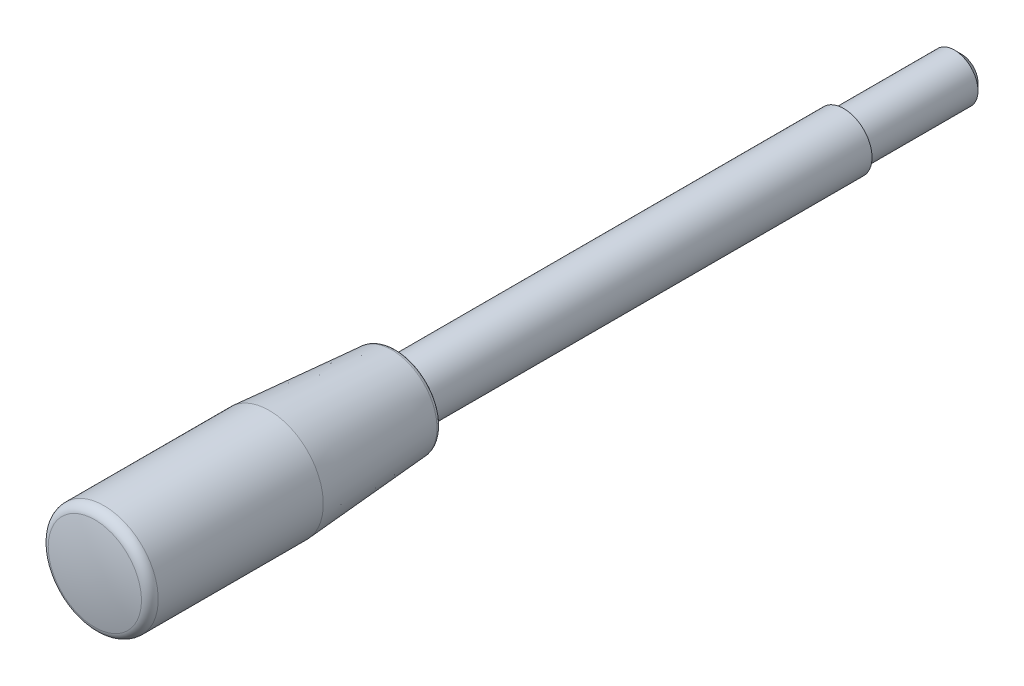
ISO-10303-21;
HEADER;
FILE_DESCRIPTION(('STEP AP214'),'2;1');
FILE_NAME('part.step','',(''),(''),'','','');
FILE_SCHEMA(('AUTOMOTIVE_DESIGN { 1 0 10303 214 1 1 1 1 }'));
ENDSEC;
DATA;
#1=APPLICATION_CONTEXT('core data for automotive mechanical design processes');
#2=APPLICATION_PROTOCOL_DEFINITION('international standard','automotive_design',2000,#1);
#3=PRODUCT_CONTEXT('',#1,'mechanical');
#4=PRODUCT('Part','Part','',(#3));
#5=PRODUCT_RELATED_PRODUCT_CATEGORY('part','',(#4));
#6=PRODUCT_DEFINITION_FORMATION('','',#4);
#7=PRODUCT_DEFINITION_CONTEXT('part definition',#1,'design');
#8=PRODUCT_DEFINITION('design','',#6,#7);
#9=PRODUCT_DEFINITION_SHAPE('','',#8);
#10=(LENGTH_UNIT() NAMED_UNIT(*) SI_UNIT(.MILLI.,.METRE.));
#11=(NAMED_UNIT(*) PLANE_ANGLE_UNIT() SI_UNIT($,.RADIAN.));
#12=(NAMED_UNIT(*) SI_UNIT($,.STERADIAN.) SOLID_ANGLE_UNIT());
#13=UNCERTAINTY_MEASURE_WITH_UNIT(LENGTH_MEASURE(1.E-05),#10,'distance_accuracy_value','');
#14=(GEOMETRIC_REPRESENTATION_CONTEXT(3) GLOBAL_UNCERTAINTY_ASSIGNED_CONTEXT((#13)) GLOBAL_UNIT_ASSIGNED_CONTEXT((#10,
#11,#12)) REPRESENTATION_CONTEXT('',''));
#15=CARTESIAN_POINT('',(0.,0.,0.));
#16=DIRECTION('',(0.,0.,1.));
#17=DIRECTION('',(1.,0.,0.));
#18=AXIS2_PLACEMENT_3D('',#15,#16,#17);
#19=CARTESIAN_POINT('',(0.,0.,-39.1515739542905));
#20=DIRECTION('',(0.,0.,-1.));
#21=DIRECTION('',(-1.,0.,0.));
#22=AXIS2_PLACEMENT_3D('',#19,#20,#21);
#23=CYLINDRICAL_SURFACE('',#22,5.);
#24=CARTESIAN_POINT('',(0.,0.,-23.5));
#25=DIRECTION('',(0.,0.,-1.));
#26=DIRECTION('',(-1.,0.,0.));
#27=AXIS2_PLACEMENT_3D('',#24,#25,#26);
#28=CIRCLE('',#27,5.);
#29=CARTESIAN_POINT('',(-5.,0.,-23.5));
#30=VERTEX_POINT('',#29);
#31=EDGE_CURVE('E8',#30,#30,#28,.T.);
#32=ORIENTED_EDGE('',*,*,#31,.F.);
#33=EDGE_LOOP('',(#32));
#34=FACE_BOUND('',#33,.T.);
#35=CARTESIAN_POINT('',(0.,0.,0.));
#36=DIRECTION('',(0.,0.,-1.));
#37=DIRECTION('',(-1.,0.,0.));
#38=AXIS2_PLACEMENT_3D('',#35,#36,#37);
#39=CIRCLE('',#38,5.);
#40=CARTESIAN_POINT('',(-5.,0.,0.));
#41=VERTEX_POINT('',#40);
#42=EDGE_CURVE('E46',#41,#41,#39,.T.);
#43=ORIENTED_EDGE('',*,*,#42,.T.);
#44=EDGE_LOOP('',(#43));
#45=FACE_BOUND('',#44,.T.);
#46=ADVANCED_FACE('F12',(#34,#45),#23,.T.);
#47=CARTESIAN_POINT('',(0.,0.,-23.5));
#48=DIRECTION('',(0.,0.,1.));
#49=DIRECTION('',(1.,0.,0.));
#50=AXIS2_PLACEMENT_3D('',#47,#48,#49);
#51=CONICAL_SURFACE('',#50,5.,0.785398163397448);
#52=CARTESIAN_POINT('',(0.,0.,-25.));
#53=DIRECTION('',(0.,0.,-1.));
#54=DIRECTION('',(-1.,0.,0.));
#55=AXIS2_PLACEMENT_3D('',#52,#53,#54);
#56=CIRCLE('',#55,3.5);
#57=CARTESIAN_POINT('',(-3.5,0.,-25.));
#58=VERTEX_POINT('',#57);
#59=EDGE_CURVE('E18',#58,#58,#56,.T.);
#60=ORIENTED_EDGE('',*,*,#59,.F.);
#61=EDGE_LOOP('',(#60));
#62=FACE_BOUND('',#61,.T.);
#63=ORIENTED_EDGE('',*,*,#31,.T.);
#64=EDGE_LOOP('',(#63));
#65=FACE_BOUND('',#64,.T.);
#66=ADVANCED_FACE('F102',(#62,#65),#51,.T.);
#67=CARTESIAN_POINT('',(0.,3.5,-25.));
#68=DIRECTION('',(0.,0.,1.));
#69=DIRECTION('',(1.,0.,0.));
#70=AXIS2_PLACEMENT_3D('',#67,#68,#69);
#71=PLANE('',#70);
#72=ORIENTED_EDGE('',*,*,#59,.T.);
#73=EDGE_LOOP('',(#72));
#74=FACE_BOUND('',#73,.T.);
#75=ADVANCED_FACE('F95',(#74),#71,.F.);
#76=CARTESIAN_POINT('',(0.,0.,110.));
#77=DIRECTION('',(-1.,0.,0.));
#78=DIRECTION('',(0.,0.,1.));
#79=AXIS2_PLACEMENT_3D('',#76,#77,#78);
#80=SPHERICAL_SURFACE('',#79,50.);
#81=CARTESIAN_POINT('',(0.,0.,110.));
#82=DIRECTION('',(0.,0.,-1.));
#83=DIRECTION('',(-1.,0.,0.));
#84=AXIS2_PLACEMENT_3D('',#81,#82,#83);
#85=SPHERICAL_SURFACE('',#84,50.);
#86=CARTESIAN_POINT('',(0.,0.,159.010942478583));
#87=DIRECTION('',(0.,0.,-1.));
#88=DIRECTION('',(-1.,0.,0.));
#89=AXIS2_PLACEMENT_3D('',#86,#87,#88);
#90=CIRCLE('',#89,9.89583333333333);
#91=CARTESIAN_POINT('',(-9.89583333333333,0.,159.010942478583));
#92=VERTEX_POINT('',#91);
#93=EDGE_CURVE('E22',#92,#92,#90,.T.);
#94=ORIENTED_EDGE('',*,*,#93,.F.);
#95=EDGE_LOOP('',(#94));
#96=FACE_BOUND('',#95,.T.);
#97=ADVANCED_FACE('F90',(#96),#85,.T.);
#98=CARTESIAN_POINT('',(0.,0.,157.050504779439));
#99=DIRECTION('',(0.,0.,-1.));
#100=DIRECTION('',(-1.,0.,0.));
#101=AXIS2_PLACEMENT_3D('',#98,#99,#100);
#102=TOROIDAL_SURFACE('',#101,9.5,1.99999999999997);
#103=CARTESIAN_POINT('',(0.,0.,157.050504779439));
#104=DIRECTION('',(0.,0.,-1.));
#105=DIRECTION('',(-1.,0.,0.));
#106=AXIS2_PLACEMENT_3D('',#103,#104,#105);
#107=CIRCLE('',#106,11.5);
#108=CARTESIAN_POINT('',(-11.5,0.,157.050504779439));
#109=VERTEX_POINT('',#108);
#110=EDGE_CURVE('E26',#109,#109,#107,.T.);
#111=ORIENTED_EDGE('',*,*,#110,.F.);
#112=EDGE_LOOP('',(#111));
#113=FACE_BOUND('',#112,.T.);
#114=ORIENTED_EDGE('',*,*,#93,.T.);
#115=EDGE_LOOP('',(#114));
#116=FACE_BOUND('',#115,.T.);
#117=ADVANCED_FACE('F84',(#113,#116),#102,.T.);
#118=CARTESIAN_POINT('',(0.,0.,-39.1515739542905));
#119=DIRECTION('',(0.,0.,-1.));
#120=DIRECTION('',(-1.,0.,0.));
#121=AXIS2_PLACEMENT_3D('',#118,#119,#120);
#122=CYLINDRICAL_SURFACE('',#121,11.5);
#123=CARTESIAN_POINT('',(0.,0.,122.));
#124=DIRECTION('',(0.,0.,-1.));
#125=DIRECTION('',(-1.,0.,0.));
#126=AXIS2_PLACEMENT_3D('',#123,#124,#125);
#127=CIRCLE('',#126,11.5);
#128=CARTESIAN_POINT('',(-11.5,0.,122.));
#129=VERTEX_POINT('',#128);
#130=EDGE_CURVE('E31',#129,#129,#127,.T.);
#131=ORIENTED_EDGE('',*,*,#130,.F.);
#132=EDGE_LOOP('',(#131));
#133=FACE_BOUND('',#132,.T.);
#134=ORIENTED_EDGE('',*,*,#110,.T.);
#135=EDGE_LOOP('',(#134));
#136=FACE_BOUND('',#135,.T.);
#137=ADVANCED_FACE('F78',(#133,#136),#122,.T.);
#138=CARTESIAN_POINT('',(0.,0.,122.));
#139=DIRECTION('',(0.,0.,1.));
#140=DIRECTION('',(1.,0.,0.));
#141=AXIS2_PLACEMENT_3D('',#138,#139,#140);
#142=CONICAL_SURFACE('',#141,11.5,0.0739390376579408);
#143=CARTESIAN_POINT('',(0.,0.,95.9261283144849));
#144=DIRECTION('',(0.,0.,-1.));
#145=DIRECTION('',(-1.,0.,0.));
#146=AXIS2_PLACEMENT_3D('',#143,#144,#145);
#147=CIRCLE('',#146,9.56860209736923);
#148=CARTESIAN_POINT('',(-9.56860209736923,0.,95.9261283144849));
#149=VERTEX_POINT('',#148);
#150=EDGE_CURVE('E34',#149,#149,#147,.T.);
#151=ORIENTED_EDGE('',*,*,#150,.F.);
#152=EDGE_LOOP('',(#151));
#153=FACE_BOUND('',#152,.T.);
#154=ORIENTED_EDGE('',*,*,#130,.T.);
#155=EDGE_LOOP('',(#154));
#156=FACE_BOUND('',#155,.T.);
#157=ADVANCED_FACE('F72',(#153,#156),#142,.T.);
#158=CARTESIAN_POINT('',(0.,0.,96.));
#159=DIRECTION('',(0.,0.,-1.));
#160=DIRECTION('',(-1.,0.,0.));
#161=AXIS2_PLACEMENT_3D('',#158,#159,#160);
#162=TOROIDAL_SURFACE('',#161,8.57133434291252,1.00000000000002);
#163=CARTESIAN_POINT('',(0.,0.,95.));
#164=DIRECTION('',(0.,0.,-1.));
#165=DIRECTION('',(-1.,0.,0.));
#166=AXIS2_PLACEMENT_3D('',#163,#164,#165);
#167=CIRCLE('',#166,8.57133434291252);
#168=CARTESIAN_POINT('',(-8.57133434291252,0.,95.));
#169=VERTEX_POINT('',#168);
#170=EDGE_CURVE('E37',#169,#169,#167,.T.);
#171=ORIENTED_EDGE('',*,*,#170,.F.);
#172=EDGE_LOOP('',(#171));
#173=FACE_BOUND('',#172,.T.);
#174=ORIENTED_EDGE('',*,*,#150,.T.);
#175=EDGE_LOOP('',(#174));
#176=FACE_BOUND('',#175,.T.);
#177=ADVANCED_FACE('F66',(#173,#176),#162,.T.);
#178=CARTESIAN_POINT('',(0.,8.57133434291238,95.));
#179=DIRECTION('',(0.,0.,1.));
#180=DIRECTION('',(1.,0.,0.));
#181=AXIS2_PLACEMENT_3D('',#178,#179,#180);
#182=PLANE('',#181);
#183=CARTESIAN_POINT('',(0.,0.,95.));
#184=DIRECTION('',(0.,0.,-1.));
#185=DIRECTION('',(-1.,0.,0.));
#186=AXIS2_PLACEMENT_3D('',#183,#184,#185);
#187=CIRCLE('',#186,6.);
#188=CARTESIAN_POINT('',(-6.,0.,95.));
#189=VERTEX_POINT('',#188);
#190=EDGE_CURVE('E40',#189,#189,#187,.T.);
#191=ORIENTED_EDGE('',*,*,#190,.F.);
#192=EDGE_LOOP('',(#191));
#193=FACE_BOUND('',#192,.T.);
#194=ORIENTED_EDGE('',*,*,#170,.T.);
#195=EDGE_LOOP('',(#194));
#196=FACE_BOUND('',#195,.T.);
#197=ADVANCED_FACE('F60',(#193,#196),#182,.F.);
#198=CARTESIAN_POINT('',(0.,0.,-39.1515739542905));
#199=DIRECTION('',(0.,0.,-1.));
#200=DIRECTION('',(-1.,0.,0.));
#201=AXIS2_PLACEMENT_3D('',#198,#199,#200);
#202=CYLINDRICAL_SURFACE('',#201,6.);
#203=CARTESIAN_POINT('',(0.,0.,0.));
#204=DIRECTION('',(0.,0.,-1.));
#205=DIRECTION('',(-1.,0.,0.));
#206=AXIS2_PLACEMENT_3D('',#203,#204,#205);
#207=CIRCLE('',#206,6.);
#208=CARTESIAN_POINT('',(-6.,0.,0.));
#209=VERTEX_POINT('',#208);
#210=EDGE_CURVE('E43',#209,#209,#207,.T.);
#211=ORIENTED_EDGE('',*,*,#210,.F.);
#212=EDGE_LOOP('',(#211));
#213=FACE_BOUND('',#212,.T.);
#214=ORIENTED_EDGE('',*,*,#190,.T.);
#215=EDGE_LOOP('',(#214));
#216=FACE_BOUND('',#215,.T.);
#217=ADVANCED_FACE('F54',(#213,#216),#202,.T.);
#218=CARTESIAN_POINT('',(0.,6.,0.));
#219=DIRECTION('',(0.,0.,1.));
#220=DIRECTION('',(1.,0.,0.));
#221=AXIS2_PLACEMENT_3D('',#218,#219,#220);
#222=PLANE('',#221);
#223=ORIENTED_EDGE('',*,*,#42,.F.);
#224=EDGE_LOOP('',(#223));
#225=FACE_BOUND('',#224,.T.);
#226=ORIENTED_EDGE('',*,*,#210,.T.);
#227=EDGE_LOOP('',(#226));
#228=FACE_BOUND('',#227,.T.);
#229=ADVANCED_FACE('F51',(#225,#228),#222,.F.);
#230=CLOSED_SHELL('',(#46,#66,#75,#97,#117,#137,#157,#177,#197,#217,#229));
#231=MANIFOLD_SOLID_BREP('B1',#230);
#232=ADVANCED_BREP_SHAPE_REPRESENTATION('',(#18,#231),#14);
#233=SHAPE_DEFINITION_REPRESENTATION(#9,#232);
ENDSEC;
END-ISO-10303-21;
